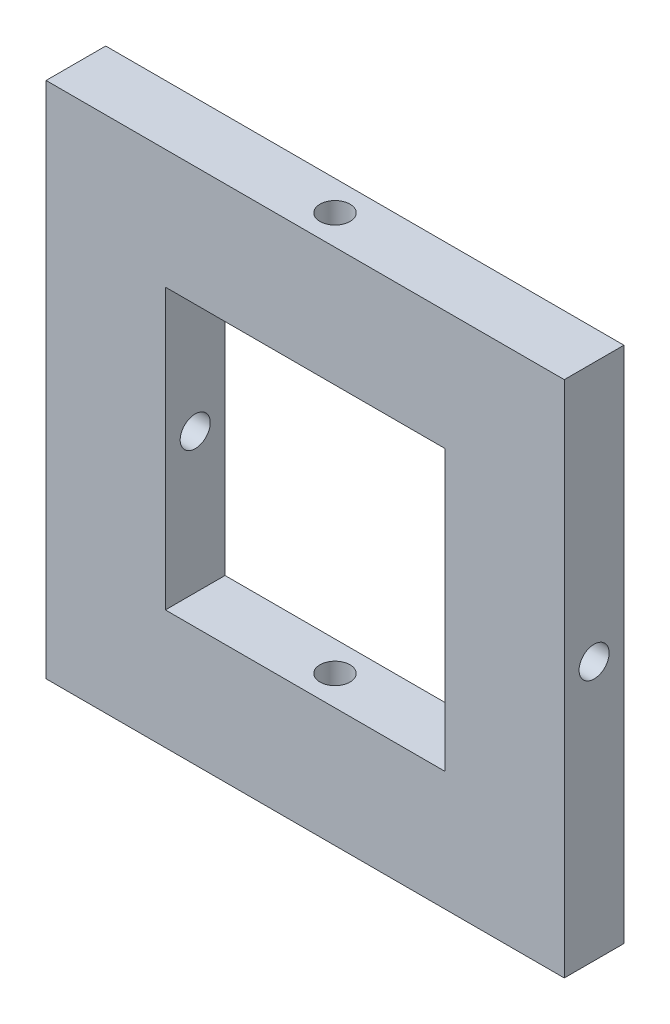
from build123d import *

# Parameters (mm, degrees)
EXTRUIR1_DEPTH        = 12.7
CROQUIS2_R            = 3.2
CORTAR_EXTRUIR1_DEPTH = 56.35
CROQUIS3_R            = 3.2
CORTAR_EXTRUIR2_DEPTH = 56.35


with BuildPart() as part:
    # Croquis1 → Extruir1 (new body)
    with BuildSketch(Plane.XY):
        Polygon((0, 55.16), (55.16, 55.16), (55.16, -55.16), (0, -55.16), (-55.16, -55.16), (-55.16, 55.16), align=None)
        Polygon((0, 29.76), (29.76, 29.76), (29.76, -29.76), (0, -29.76), (-29.76, -29.76), (-29.76, 29.76), align=None, mode=Mode.SUBTRACT)
    extrude(amount=EXTRUIR1_DEPTH)

    # Croquis2 → Cortar-Extruir1 (cut, symmetric)
    with BuildSketch(Plane(origin=(0, 0, 0), x_dir=(1, 0, 0), z_dir=(0, 1, 0))):
        with Locations(Location((0, -6.35, 0), (0, 0, 90))):
            Circle(CROQUIS2_R)
    extrude(amount=CORTAR_EXTRUIR1_DEPTH, both=True, mode=Mode.SUBTRACT)

    # Croquis3 → Cortar-Extruir2 (cut, symmetric)
    with BuildSketch(Plane(origin=(0, 0, 0), x_dir=(0, 0, -1), z_dir=(1, 0, 0))):
        with Locations(Location((-6.35, 0, 0), (0, 0, 180))):
            Circle(CROQUIS3_R)
    extrude(amount=CORTAR_EXTRUIR2_DEPTH, both=True, mode=Mode.SUBTRACT)


solid = part.part
